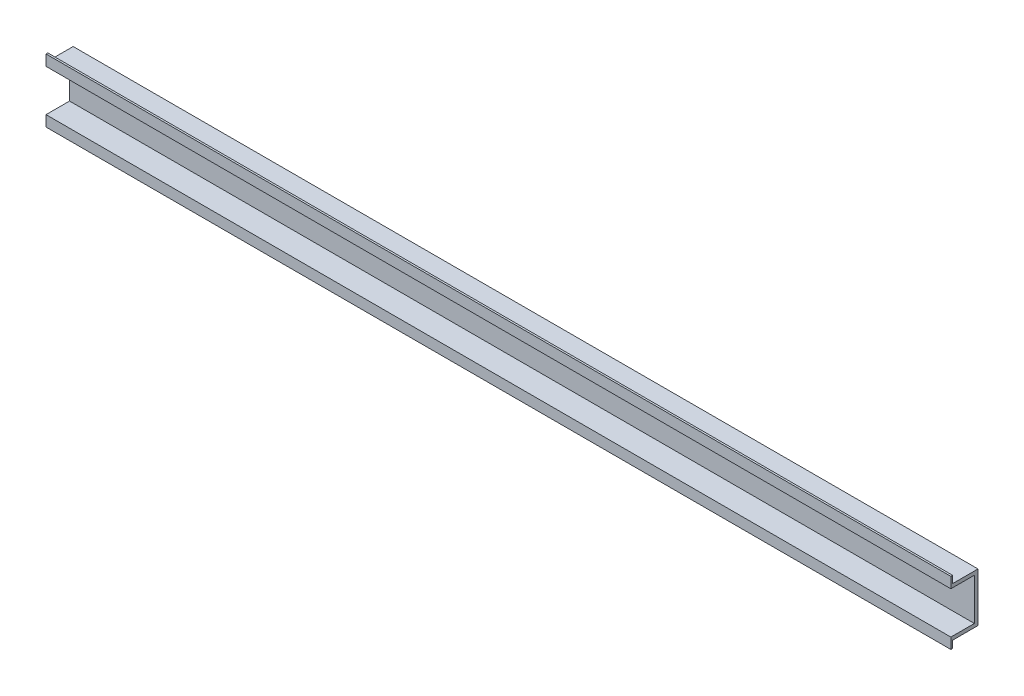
ISO-10303-21;
HEADER;
FILE_DESCRIPTION(('STEP AP214'),'2;1');
FILE_NAME('part.step','',(''),(''),'','','');
FILE_SCHEMA(('AUTOMOTIVE_DESIGN { 1 0 10303 214 1 1 1 1 }'));
ENDSEC;
DATA;
#1=APPLICATION_CONTEXT('core data for automotive mechanical design processes');
#2=APPLICATION_PROTOCOL_DEFINITION('international standard','automotive_design',2000,#1);
#3=PRODUCT_CONTEXT('',#1,'mechanical');
#4=PRODUCT('Part','Part','',(#3));
#5=PRODUCT_RELATED_PRODUCT_CATEGORY('part','',(#4));
#6=PRODUCT_DEFINITION_FORMATION('','',#4);
#7=PRODUCT_DEFINITION_CONTEXT('part definition',#1,'design');
#8=PRODUCT_DEFINITION('design','',#6,#7);
#9=PRODUCT_DEFINITION_SHAPE('','',#8);
#10=(LENGTH_UNIT() NAMED_UNIT(*) SI_UNIT(.MILLI.,.METRE.));
#11=(NAMED_UNIT(*) PLANE_ANGLE_UNIT() SI_UNIT($,.RADIAN.));
#12=(NAMED_UNIT(*) SI_UNIT($,.STERADIAN.) SOLID_ANGLE_UNIT());
#13=UNCERTAINTY_MEASURE_WITH_UNIT(LENGTH_MEASURE(1.E-05),#10,'distance_accuracy_value','');
#14=(GEOMETRIC_REPRESENTATION_CONTEXT(3) GLOBAL_UNCERTAINTY_ASSIGNED_CONTEXT((#13)) GLOBAL_UNIT_ASSIGNED_CONTEXT((#10,
#11,#12)) REPRESENTATION_CONTEXT('',''));
#15=CARTESIAN_POINT('',(0.,0.,0.));
#16=DIRECTION('',(0.,0.,1.));
#17=DIRECTION('',(1.,0.,0.));
#18=AXIS2_PLACEMENT_3D('',#15,#16,#17);
#19=CARTESIAN_POINT('',(500.,-11.55,15.));
#20=DIRECTION('',(0.,0.,-1.));
#21=DIRECTION('',(-1.,0.,0.));
#22=AXIS2_PLACEMENT_3D('',#19,#20,#21);
#23=PLANE('',#22);
#24=DIRECTION('',(0.,-1.,0.));
#25=VECTOR('',#24,1.);
#26=CARTESIAN_POINT('',(0.,-11.55,15.));
#27=LINE('',#26,#25);
#28=CARTESIAN_POINT('',(0.,-11.55,15.));
#29=VERTEX_POINT('',#28);
#30=CARTESIAN_POINT('',(0.,-17.5,15.));
#31=VERTEX_POINT('',#30);
#32=EDGE_CURVE('E156',#29,#31,#27,.T.);
#33=ORIENTED_EDGE('',*,*,#32,.T.);
#34=DIRECTION('',(-1.,0.,0.));
#35=VECTOR('',#34,1.);
#36=CARTESIAN_POINT('',(500.,-17.5,15.));
#37=LINE('',#36,#35);
#38=CARTESIAN_POINT('',(500.,-17.5,15.));
#39=VERTEX_POINT('',#38);
#40=EDGE_CURVE('E11',#39,#31,#37,.T.);
#41=ORIENTED_EDGE('',*,*,#40,.F.);
#42=DIRECTION('',(0.,-1.,0.));
#43=VECTOR('',#42,1.);
#44=CARTESIAN_POINT('',(500.,-11.55,15.));
#45=LINE('',#44,#43);
#46=CARTESIAN_POINT('',(500.,-11.55,15.));
#47=VERTEX_POINT('',#46);
#48=EDGE_CURVE('E178',#47,#39,#45,.T.);
#49=ORIENTED_EDGE('',*,*,#48,.F.);
#50=DIRECTION('',(-1.,0.,0.));
#51=VECTOR('',#50,1.);
#52=CARTESIAN_POINT('',(500.,-11.55,15.));
#53=LINE('',#52,#51);
#54=EDGE_CURVE('E152',#47,#29,#53,.T.);
#55=ORIENTED_EDGE('',*,*,#54,.T.);
#56=EDGE_LOOP('',(#33,#41,#49,#55));
#57=FACE_BOUND('',#56,.T.);
#58=ADVANCED_FACE('F36',(#57),#23,.F.);
#59=CARTESIAN_POINT('',(500.,-17.5,15.));
#60=DIRECTION('',(0.,1.,0.));
#61=DIRECTION('',(0.,0.,1.));
#62=AXIS2_PLACEMENT_3D('',#59,#60,#61);
#63=PLANE('',#62);
#64=DIRECTION('',(0.,0.,-1.));
#65=VECTOR('',#64,1.);
#66=CARTESIAN_POINT('',(0.,-17.5,15.));
#67=LINE('',#66,#65);
#68=CARTESIAN_POINT('',(0.,-17.5,14.));
#69=VERTEX_POINT('',#68);
#70=EDGE_CURVE('E159',#31,#69,#67,.T.);
#71=ORIENTED_EDGE('',*,*,#70,.T.);
#72=DIRECTION('',(-1.,0.,0.));
#73=VECTOR('',#72,1.);
#74=CARTESIAN_POINT('',(500.,-17.5,14.));
#75=LINE('',#74,#73);
#76=CARTESIAN_POINT('',(500.,-17.5,14.));
#77=VERTEX_POINT('',#76);
#78=EDGE_CURVE('E44',#77,#69,#75,.T.);
#79=ORIENTED_EDGE('',*,*,#78,.F.);
#80=DIRECTION('',(0.,0.,-1.));
#81=VECTOR('',#80,1.);
#82=CARTESIAN_POINT('',(500.,-17.5,15.));
#83=LINE('',#82,#81);
#84=EDGE_CURVE('E107',#39,#77,#83,.T.);
#85=ORIENTED_EDGE('',*,*,#84,.F.);
#86=ORIENTED_EDGE('',*,*,#40,.T.);
#87=EDGE_LOOP('',(#71,#79,#85,#86));
#88=FACE_BOUND('',#87,.T.);
#89=ADVANCED_FACE('F256',(#88),#63,.F.);
#90=CARTESIAN_POINT('',(500.,-13.55,14.));
#91=DIRECTION('',(0.,0.,1.));
#92=DIRECTION('',(1.,0.,0.));
#93=AXIS2_PLACEMENT_3D('',#90,#91,#92);
#94=PLANE('',#93);
#95=DIRECTION('',(0.,1.,0.));
#96=VECTOR('',#95,1.);
#97=CARTESIAN_POINT('',(0.,-13.55,14.));
#98=LINE('',#97,#96);
#99=CARTESIAN_POINT('',(0.,-13.55,14.));
#100=VERTEX_POINT('',#99);
#101=EDGE_CURVE('E161',#69,#100,#98,.T.);
#102=ORIENTED_EDGE('',*,*,#101,.T.);
#103=DIRECTION('',(-1.,0.,0.));
#104=VECTOR('',#103,1.);
#105=CARTESIAN_POINT('',(500.,-13.55,14.));
#106=LINE('',#105,#104);
#107=CARTESIAN_POINT('',(500.,-13.55,14.));
#108=VERTEX_POINT('',#107);
#109=EDGE_CURVE('E197',#108,#100,#106,.T.);
#110=ORIENTED_EDGE('',*,*,#109,.F.);
#111=DIRECTION('',(0.,1.,0.));
#112=VECTOR('',#111,1.);
#113=CARTESIAN_POINT('',(500.,-13.55,14.));
#114=LINE('',#113,#112);
#115=EDGE_CURVE('E205',#77,#108,#114,.T.);
#116=ORIENTED_EDGE('',*,*,#115,.F.);
#117=ORIENTED_EDGE('',*,*,#78,.T.);
#118=EDGE_LOOP('',(#102,#110,#116,#117));
#119=FACE_BOUND('',#118,.T.);
#120=ADVANCED_FACE('F203',(#119),#94,.F.);
#121=CARTESIAN_POINT('',(500.,-13.55,14.));
#122=DIRECTION('',(0.,1.,0.));
#123=DIRECTION('',(0.,0.,1.));
#124=AXIS2_PLACEMENT_3D('',#121,#122,#123);
#125=PLANE('',#124);
#126=DIRECTION('',(0.,0.,-1.));
#127=VECTOR('',#126,1.);
#128=CARTESIAN_POINT('',(0.,-13.55,14.));
#129=LINE('',#128,#127);
#130=CARTESIAN_POINT('',(0.,-13.55,0.));
#131=VERTEX_POINT('',#130);
#132=EDGE_CURVE('E163',#100,#131,#129,.T.);
#133=ORIENTED_EDGE('',*,*,#132,.T.);
#134=DIRECTION('',(-1.,0.,0.));
#135=VECTOR('',#134,1.);
#136=CARTESIAN_POINT('',(500.,-13.55,0.));
#137=LINE('',#136,#135);
#138=CARTESIAN_POINT('',(500.,-13.55,0.));
#139=VERTEX_POINT('',#138);
#140=EDGE_CURVE('E194',#139,#131,#137,.T.);
#141=ORIENTED_EDGE('',*,*,#140,.F.);
#142=DIRECTION('',(0.,0.,-1.));
#143=VECTOR('',#142,1.);
#144=CARTESIAN_POINT('',(500.,-13.55,14.));
#145=LINE('',#144,#143);
#146=EDGE_CURVE('E223',#108,#139,#145,.T.);
#147=ORIENTED_EDGE('',*,*,#146,.F.);
#148=ORIENTED_EDGE('',*,*,#109,.T.);
#149=EDGE_LOOP('',(#133,#141,#147,#148));
#150=FACE_BOUND('',#149,.T.);
#151=ADVANCED_FACE('F214',(#150),#125,.F.);
#152=CARTESIAN_POINT('',(500.,-13.55,0.));
#153=DIRECTION('',(0.,0.,1.));
#154=DIRECTION('',(0.,-1.,0.));
#155=AXIS2_PLACEMENT_3D('',#152,#153,#154);
#156=PLANE('',#155);
#157=DIRECTION('',(0.,1.,0.));
#158=VECTOR('',#157,1.);
#159=CARTESIAN_POINT('',(0.,-13.55,0.));
#160=LINE('',#159,#158);
#161=CARTESIAN_POINT('',(0.,13.55,0.));
#162=VERTEX_POINT('',#161);
#163=EDGE_CURVE('E165',#131,#162,#160,.T.);
#164=ORIENTED_EDGE('',*,*,#163,.T.);
#165=DIRECTION('',(-1.,0.,0.));
#166=VECTOR('',#165,1.);
#167=CARTESIAN_POINT('',(500.,13.55,0.));
#168=LINE('',#167,#166);
#169=CARTESIAN_POINT('',(500.,13.55,0.));
#170=VERTEX_POINT('',#169);
#171=EDGE_CURVE('E191',#170,#162,#168,.T.);
#172=ORIENTED_EDGE('',*,*,#171,.F.);
#173=DIRECTION('',(0.,1.,0.));
#174=VECTOR('',#173,1.);
#175=CARTESIAN_POINT('',(500.,-13.55,0.));
#176=LINE('',#175,#174);
#177=EDGE_CURVE('E220',#139,#170,#176,.T.);
#178=ORIENTED_EDGE('',*,*,#177,.F.);
#179=ORIENTED_EDGE('',*,*,#140,.T.);
#180=EDGE_LOOP('',(#164,#172,#178,#179));
#181=FACE_BOUND('',#180,.T.);
#182=ADVANCED_FACE('F218',(#181),#156,.F.);
#183=CARTESIAN_POINT('',(500.,13.55,0.));
#184=DIRECTION('',(0.,-1.,0.));
#185=DIRECTION('',(0.,0.,-1.));
#186=AXIS2_PLACEMENT_3D('',#183,#184,#185);
#187=PLANE('',#186);
#188=DIRECTION('',(0.,0.,1.));
#189=VECTOR('',#188,1.);
#190=CARTESIAN_POINT('',(0.,13.55,0.));
#191=LINE('',#190,#189);
#192=CARTESIAN_POINT('',(0.,13.55,14.));
#193=VERTEX_POINT('',#192);
#194=EDGE_CURVE('E167',#162,#193,#191,.T.);
#195=ORIENTED_EDGE('',*,*,#194,.T.);
#196=DIRECTION('',(-1.,0.,0.));
#197=VECTOR('',#196,1.);
#198=CARTESIAN_POINT('',(500.,13.55,14.));
#199=LINE('',#198,#197);
#200=CARTESIAN_POINT('',(500.,13.55,14.));
#201=VERTEX_POINT('',#200);
#202=EDGE_CURVE('E188',#201,#193,#199,.T.);
#203=ORIENTED_EDGE('',*,*,#202,.F.);
#204=DIRECTION('',(0.,0.,1.));
#205=VECTOR('',#204,1.);
#206=CARTESIAN_POINT('',(500.,13.55,0.));
#207=LINE('',#206,#205);
#208=EDGE_CURVE('E222',#170,#201,#207,.T.);
#209=ORIENTED_EDGE('',*,*,#208,.F.);
#210=ORIENTED_EDGE('',*,*,#171,.T.);
#211=EDGE_LOOP('',(#195,#203,#209,#210));
#212=FACE_BOUND('',#211,.T.);
#213=ADVANCED_FACE('F269',(#212),#187,.F.);
#214=CARTESIAN_POINT('',(500.,17.5,14.));
#215=DIRECTION('',(0.,0.,1.));
#216=DIRECTION('',(1.,0.,0.));
#217=AXIS2_PLACEMENT_3D('',#214,#215,#216);
#218=PLANE('',#217);
#219=DIRECTION('',(0.,1.,0.));
#220=VECTOR('',#219,1.);
#221=CARTESIAN_POINT('',(0.,17.5,14.));
#222=LINE('',#221,#220);
#223=CARTESIAN_POINT('',(0.,17.5,14.));
#224=VERTEX_POINT('',#223);
#225=EDGE_CURVE('E169',#193,#224,#222,.T.);
#226=ORIENTED_EDGE('',*,*,#225,.T.);
#227=DIRECTION('',(-1.,0.,0.));
#228=VECTOR('',#227,1.);
#229=CARTESIAN_POINT('',(500.,17.5,14.));
#230=LINE('',#229,#228);
#231=CARTESIAN_POINT('',(500.,17.5,14.));
#232=VERTEX_POINT('',#231);
#233=EDGE_CURVE('E185',#232,#224,#230,.T.);
#234=ORIENTED_EDGE('',*,*,#233,.F.);
#235=DIRECTION('',(0.,1.,0.));
#236=VECTOR('',#235,1.);
#237=CARTESIAN_POINT('',(500.,17.5,14.));
#238=LINE('',#237,#236);
#239=EDGE_CURVE('E225',#201,#232,#238,.T.);
#240=ORIENTED_EDGE('',*,*,#239,.F.);
#241=ORIENTED_EDGE('',*,*,#202,.T.);
#242=EDGE_LOOP('',(#226,#234,#240,#241));
#243=FACE_BOUND('',#242,.T.);
#244=ADVANCED_FACE('F272',(#243),#218,.F.);
#245=CARTESIAN_POINT('',(500.,17.5,14.));
#246=DIRECTION('',(0.,-1.,0.));
#247=DIRECTION('',(0.,0.,-1.));
#248=AXIS2_PLACEMENT_3D('',#245,#246,#247);
#249=PLANE('',#248);
#250=DIRECTION('',(0.,0.,1.));
#251=VECTOR('',#250,1.);
#252=CARTESIAN_POINT('',(0.,17.5,14.));
#253=LINE('',#252,#251);
#254=CARTESIAN_POINT('',(0.,17.5,15.));
#255=VERTEX_POINT('',#254);
#256=EDGE_CURVE('E171',#224,#255,#253,.T.);
#257=ORIENTED_EDGE('',*,*,#256,.T.);
#258=DIRECTION('',(-1.,0.,0.));
#259=VECTOR('',#258,1.);
#260=CARTESIAN_POINT('',(500.,17.5,15.));
#261=LINE('',#260,#259);
#262=CARTESIAN_POINT('',(500.,17.5,15.));
#263=VERTEX_POINT('',#262);
#264=EDGE_CURVE('E182',#263,#255,#261,.T.);
#265=ORIENTED_EDGE('',*,*,#264,.F.);
#266=DIRECTION('',(0.,0.,1.));
#267=VECTOR('',#266,1.);
#268=CARTESIAN_POINT('',(500.,17.5,14.));
#269=LINE('',#268,#267);
#270=EDGE_CURVE('E231',#232,#263,#269,.T.);
#271=ORIENTED_EDGE('',*,*,#270,.F.);
#272=ORIENTED_EDGE('',*,*,#233,.T.);
#273=EDGE_LOOP('',(#257,#265,#271,#272));
#274=FACE_BOUND('',#273,.T.);
#275=ADVANCED_FACE('F237',(#274),#249,.F.);
#276=CARTESIAN_POINT('',(500.,17.5,15.));
#277=DIRECTION('',(0.,0.,-1.));
#278=DIRECTION('',(-1.,0.,0.));
#279=AXIS2_PLACEMENT_3D('',#276,#277,#278);
#280=PLANE('',#279);
#281=DIRECTION('',(0.,-1.,0.));
#282=VECTOR('',#281,1.);
#283=CARTESIAN_POINT('',(0.,17.5,15.));
#284=LINE('',#283,#282);
#285=CARTESIAN_POINT('',(0.,11.55,15.));
#286=VERTEX_POINT('',#285);
#287=EDGE_CURVE('E173',#255,#286,#284,.T.);
#288=ORIENTED_EDGE('',*,*,#287,.T.);
#289=DIRECTION('',(-1.,0.,0.));
#290=VECTOR('',#289,1.);
#291=CARTESIAN_POINT('',(500.,11.55,15.));
#292=LINE('',#291,#290);
#293=CARTESIAN_POINT('',(500.,11.55,15.));
#294=VERTEX_POINT('',#293);
#295=EDGE_CURVE('E147',#294,#286,#292,.T.);
#296=ORIENTED_EDGE('',*,*,#295,.F.);
#297=DIRECTION('',(0.,-1.,0.));
#298=VECTOR('',#297,1.);
#299=CARTESIAN_POINT('',(500.,17.5,15.));
#300=LINE('',#299,#298);
#301=EDGE_CURVE('E138',#263,#294,#300,.T.);
#302=ORIENTED_EDGE('',*,*,#301,.F.);
#303=ORIENTED_EDGE('',*,*,#264,.T.);
#304=EDGE_LOOP('',(#288,#296,#302,#303));
#305=FACE_BOUND('',#304,.T.);
#306=ADVANCED_FACE('F241',(#305),#280,.F.);
#307=CARTESIAN_POINT('',(500.,11.55,2.));
#308=DIRECTION('',(0.,1.,0.));
#309=DIRECTION('',(0.,0.,1.));
#310=AXIS2_PLACEMENT_3D('',#307,#308,#309);
#311=PLANE('',#310);
#312=DIRECTION('',(0.,0.,-1.));
#313=VECTOR('',#312,1.);
#314=CARTESIAN_POINT('',(0.,11.55,2.));
#315=LINE('',#314,#313);
#316=CARTESIAN_POINT('',(0.,11.55,2.));
#317=VERTEX_POINT('',#316);
#318=EDGE_CURVE('E146',#286,#317,#315,.T.);
#319=ORIENTED_EDGE('',*,*,#318,.T.);
#320=DIRECTION('',(-1.,0.,0.));
#321=VECTOR('',#320,1.);
#322=CARTESIAN_POINT('',(500.,11.55,2.));
#323=LINE('',#322,#321);
#324=CARTESIAN_POINT('',(500.,11.55,2.));
#325=VERTEX_POINT('',#324);
#326=EDGE_CURVE('E143',#325,#317,#323,.T.);
#327=ORIENTED_EDGE('',*,*,#326,.F.);
#328=DIRECTION('',(0.,0.,-1.));
#329=VECTOR('',#328,1.);
#330=CARTESIAN_POINT('',(500.,11.55,2.));
#331=LINE('',#330,#329);
#332=EDGE_CURVE('E132',#294,#325,#331,.T.);
#333=ORIENTED_EDGE('',*,*,#332,.F.);
#334=ORIENTED_EDGE('',*,*,#295,.T.);
#335=EDGE_LOOP('',(#319,#327,#333,#334));
#336=FACE_BOUND('',#335,.T.);
#337=ADVANCED_FACE('F144',(#336),#311,.F.);
#338=CARTESIAN_POINT('',(500.,-11.55,2.));
#339=DIRECTION('',(0.,0.,-1.));
#340=DIRECTION('',(0.,1.,0.));
#341=AXIS2_PLACEMENT_3D('',#338,#339,#340);
#342=PLANE('',#341);
#343=DIRECTION('',(0.,-1.,0.));
#344=VECTOR('',#343,1.);
#345=CARTESIAN_POINT('',(0.,-11.55,2.));
#346=LINE('',#345,#344);
#347=CARTESIAN_POINT('',(0.,-11.55,2.));
#348=VERTEX_POINT('',#347);
#349=EDGE_CURVE('E93',#317,#348,#346,.T.);
#350=ORIENTED_EDGE('',*,*,#349,.T.);
#351=DIRECTION('',(-1.,0.,0.));
#352=VECTOR('',#351,1.);
#353=CARTESIAN_POINT('',(500.,-11.55,2.));
#354=LINE('',#353,#352);
#355=CARTESIAN_POINT('',(500.,-11.55,2.));
#356=VERTEX_POINT('',#355);
#357=EDGE_CURVE('E148',#356,#348,#354,.T.);
#358=ORIENTED_EDGE('',*,*,#357,.F.);
#359=DIRECTION('',(0.,-1.,0.));
#360=VECTOR('',#359,1.);
#361=CARTESIAN_POINT('',(500.,-11.55,2.));
#362=LINE('',#361,#360);
#363=EDGE_CURVE('E136',#325,#356,#362,.T.);
#364=ORIENTED_EDGE('',*,*,#363,.F.);
#365=ORIENTED_EDGE('',*,*,#326,.T.);
#366=EDGE_LOOP('',(#350,#358,#364,#365));
#367=FACE_BOUND('',#366,.T.);
#368=ADVANCED_FACE('F150',(#367),#342,.F.);
#369=CARTESIAN_POINT('',(500.,-11.55,15.));
#370=DIRECTION('',(0.,-1.,0.));
#371=DIRECTION('',(0.,0.,-1.));
#372=AXIS2_PLACEMENT_3D('',#369,#370,#371);
#373=PLANE('',#372);
#374=DIRECTION('',(0.,0.,1.));
#375=VECTOR('',#374,1.);
#376=CARTESIAN_POINT('',(0.,-11.55,15.));
#377=LINE('',#376,#375);
#378=EDGE_CURVE('E99',#348,#29,#377,.T.);
#379=ORIENTED_EDGE('',*,*,#378,.T.);
#380=ORIENTED_EDGE('',*,*,#54,.F.);
#381=DIRECTION('',(0.,0.,1.));
#382=VECTOR('',#381,1.);
#383=CARTESIAN_POINT('',(500.,-11.55,15.));
#384=LINE('',#383,#382);
#385=EDGE_CURVE('E52',#356,#47,#384,.T.);
#386=ORIENTED_EDGE('',*,*,#385,.F.);
#387=ORIENTED_EDGE('',*,*,#357,.T.);
#388=EDGE_LOOP('',(#379,#380,#386,#387));
#389=FACE_BOUND('',#388,.T.);
#390=ADVANCED_FACE('F245',(#389),#373,.F.);
#391=CARTESIAN_POINT('',(500.,-17.5,15.));
#392=DIRECTION('',(1.,0.,0.));
#393=DIRECTION('',(0.,0.,-1.));
#394=AXIS2_PLACEMENT_3D('',#391,#392,#393);
#395=PLANE('',#394);
#396=ORIENTED_EDGE('',*,*,#48,.T.);
#397=ORIENTED_EDGE('',*,*,#84,.T.);
#398=ORIENTED_EDGE('',*,*,#115,.T.);
#399=ORIENTED_EDGE('',*,*,#146,.T.);
#400=ORIENTED_EDGE('',*,*,#177,.T.);
#401=ORIENTED_EDGE('',*,*,#208,.T.);
#402=ORIENTED_EDGE('',*,*,#239,.T.);
#403=ORIENTED_EDGE('',*,*,#270,.T.);
#404=ORIENTED_EDGE('',*,*,#301,.T.);
#405=ORIENTED_EDGE('',*,*,#332,.T.);
#406=ORIENTED_EDGE('',*,*,#363,.T.);
#407=ORIENTED_EDGE('',*,*,#385,.T.);
#408=EDGE_LOOP('',(#396,#397,#398,#399,#400,#401,#402,#403,#404,#405,#406,#407));
#409=FACE_BOUND('',#408,.T.);
#410=ADVANCED_FACE('F134',(#409),#395,.T.);
#411=CARTESIAN_POINT('',(0.,-17.5,15.));
#412=DIRECTION('',(1.,0.,0.));
#413=DIRECTION('',(0.,0.,-1.));
#414=AXIS2_PLACEMENT_3D('',#411,#412,#413);
#415=PLANE('',#414);
#416=ORIENTED_EDGE('',*,*,#32,.F.);
#417=ORIENTED_EDGE('',*,*,#378,.F.);
#418=ORIENTED_EDGE('',*,*,#349,.F.);
#419=ORIENTED_EDGE('',*,*,#318,.F.);
#420=ORIENTED_EDGE('',*,*,#287,.F.);
#421=ORIENTED_EDGE('',*,*,#256,.F.);
#422=ORIENTED_EDGE('',*,*,#225,.F.);
#423=ORIENTED_EDGE('',*,*,#194,.F.);
#424=ORIENTED_EDGE('',*,*,#163,.F.);
#425=ORIENTED_EDGE('',*,*,#132,.F.);
#426=ORIENTED_EDGE('',*,*,#101,.F.);
#427=ORIENTED_EDGE('',*,*,#70,.F.);
#428=EDGE_LOOP('',(#416,#417,#418,#419,#420,#421,#422,#423,#424,#425,#426,#427));
#429=FACE_BOUND('',#428,.T.);
#430=ADVANCED_FACE('F209',(#429),#415,.F.);
#431=CLOSED_SHELL('',(#58,#89,#120,#151,#182,#213,#244,#275,#306,#337,#368,#390,#410,#430));
#432=MANIFOLD_SOLID_BREP('B2',#431);
#433=ADVANCED_BREP_SHAPE_REPRESENTATION('',(#18,#432),#14);
#434=SHAPE_DEFINITION_REPRESENTATION(#9,#433);
ENDSEC;
END-ISO-10303-21;
